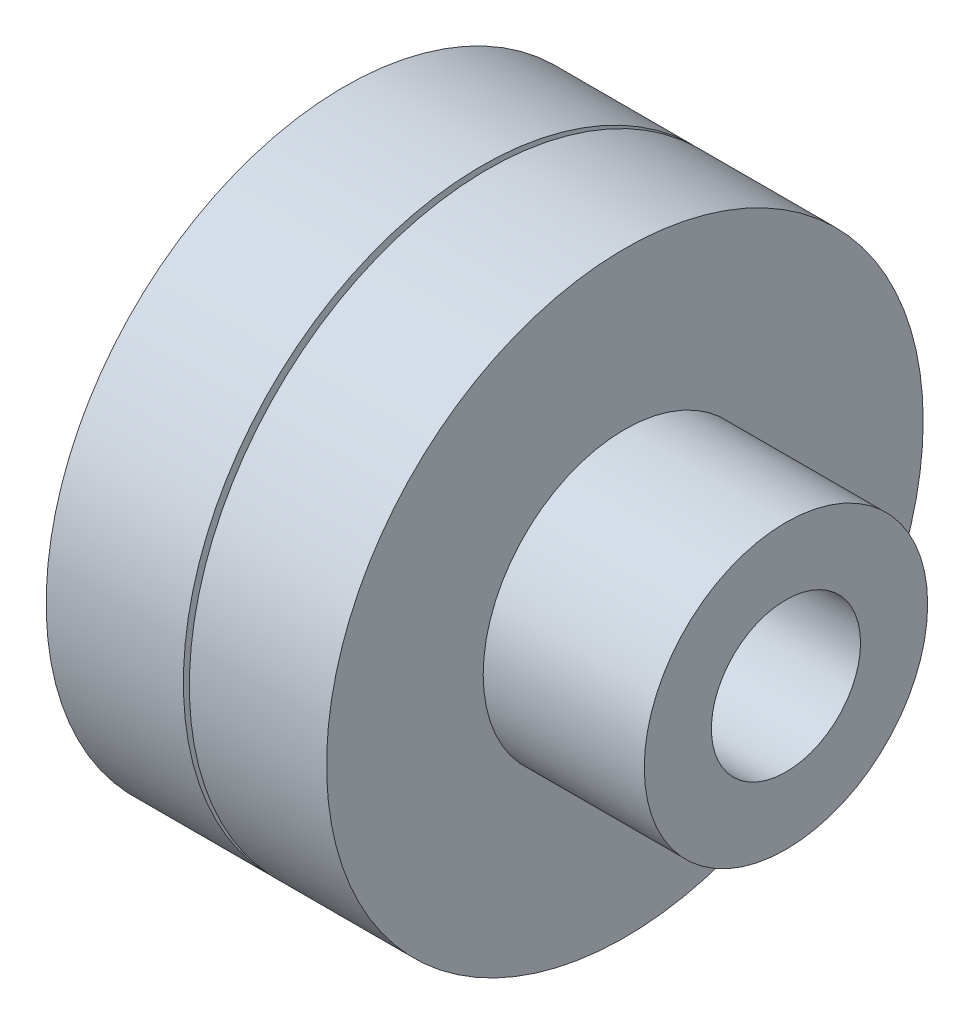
from build123d import *


with BuildPart() as part:
    # Sketch1 → Revolve1 (revolve)
    with BuildSketch(Plane.XY, mode=Mode.PRIVATE) as revolve1_sk:
        Polygon((-167, -30), (-102, -30), (-102, -100), (-148, -100), (-148, -47.5), (-167, -47.5), align=None)
        Polygon((0, -47.5), (0, -25), (-100, -25), (-100, -100), (-54, -100), (-54, -47.5), align=None)
    revolve(revolve1_sk.sketch.rotate(Axis((0, 0, 0), (-1, 0, 0)), 270), axis=Axis((0, 0, 0), (-1, 0, 0)))


solid = part.part
